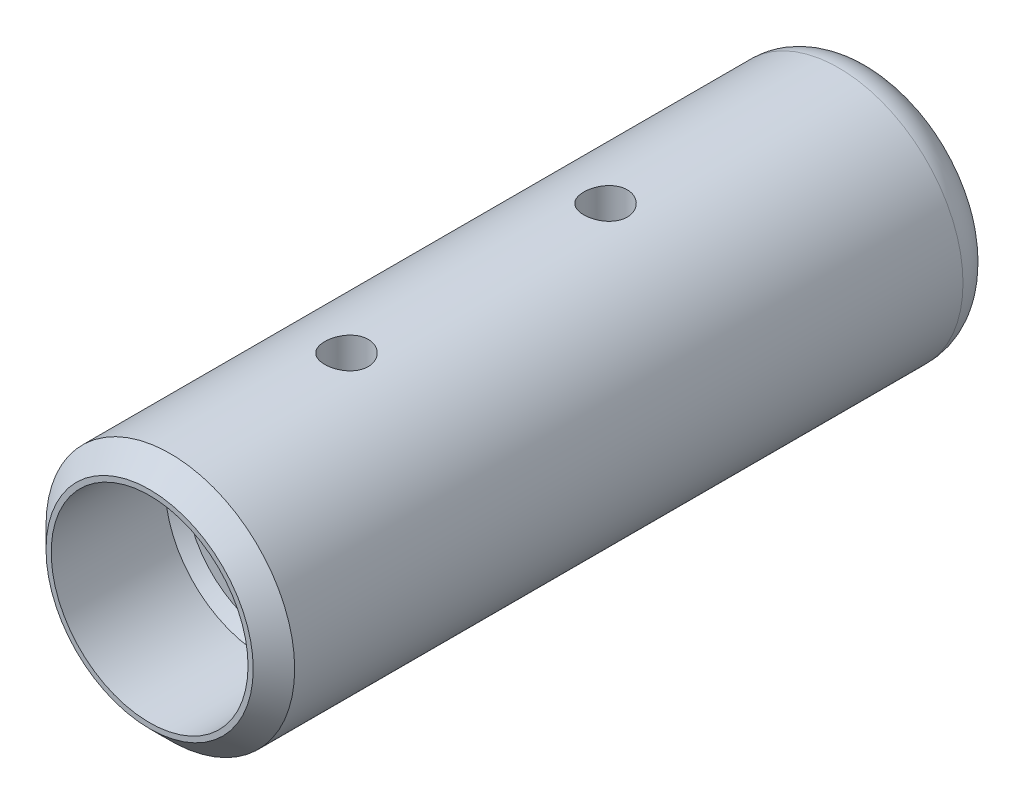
from build123d import *

# Parameters (mm, degrees)
ESQUISSE1_R                         = 12
BASE_EXTRUSION_DEPTH                = 70
CHANFREIN2_SIZE                     = 2
ESQUISSE2_R                         = 9.5
ENL_V_MAT_EXTRU_1_DEPTH             = 12
CHANFREIN3_SIZE                     = 1
DIAM_TRE_DU_PER_AGE_8_5_8_5_1_D     = 8.5
DIAM_TRE_DU_PER_AGE_8_5_8_5_1_DEPTH = 40
DIAM_TRE_DU_PER_AGE_8_5_8_5_1_TIP   = 2.553657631
ENL_V_MAT_EXTRU_2_REACH             = 76.967
ENL_V_MAT_EXTRU_2_END_RADIUS        = 4.25
ESQUISSE6_R                         = 2.1
CONG_1_R                            = 3.5
BOSS_EXTRU_1_REACH                  = 76.967
BOSS_EXTRU_1_END_RADIUS             = 12
ESQUISSE10_W                        = 11.941376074
ESQUISSE10_H                        = 36.669535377
ESQUISSE10_R                        = 2.1
ESQUISSE16_R                        = 19.918458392
ESQUISSE16_R_2                      = 12
ENL_V_MAT_EXTRU_3_DEPTH             = 73.027772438


with BuildPart() as part:
    # Esquisse1 → Base-Extrusion (new body)
    with BuildSketch(Plane.XY):
        Circle(ESQUISSE1_R)
    extrude(amount=BASE_EXTRUSION_DEPTH)

    # Chanfrein2
    chanfrein2_edges = [part.edges().sort_by_distance(p)[0] for p in [
        (-12, 0, 70),
    ]]
    chamfer(chanfrein2_edges, length=CHANFREIN2_SIZE)

    # Esquisse2 → Enl_v. mat.-Extru.1 (cut)
    with BuildSketch(Plane.XY.offset(70)):
        Circle(ESQUISSE2_R)
    extrude(amount=-ENL_V_MAT_EXTRU_1_DEPTH, mode=Mode.SUBTRACT)

    # Chanfrein3
    chanfrein3_edges = [part.edges().sort_by_distance(p)[0] for p in [
        (-9.5, 0, 58),
    ]]
    chamfer(chanfrein3_edges, length=CHANFREIN3_SIZE)

    # Diam_tre du per_age _8.5 _8.5_1
    with Locations(Plane.XY.offset(58)):
        with Locations((0, 0)):
            Hole(DIAM_TRE_DU_PER_AGE_8_5_8_5_1_D / 2, depth=DIAM_TRE_DU_PER_AGE_8_5_8_5_1_DEPTH)
            with Locations((0, 0, -(DIAM_TRE_DU_PER_AGE_8_5_8_5_1_DEPTH + DIAM_TRE_DU_PER_AGE_8_5_8_5_1_TIP / 2))):  # 118° drill point
                Cone(0, DIAM_TRE_DU_PER_AGE_8_5_8_5_1_D / 2, DIAM_TRE_DU_PER_AGE_8_5_8_5_1_TIP, mode=Mode.SUBTRACT)

    # Enl_v. mat.-Extru.2: up to this cylinder (the profile starts outside it)
    enl_v_mat_extru_2_end = Plane(origin=(0, 0, 38.5), z_dir=(0, 0, 1)) * Cylinder(ENL_V_MAT_EXTRU_2_END_RADIUS, 188.434, mode=Mode.PRIVATE)
    # Esquisse6 → Enl_v. mat.-Extru.2 (cut, up to the surface)
    with BuildSketch(Plane(origin=(0, 12, 0), x_dir=(-1, 0, 0), z_dir=(0, 1, 0)), mode=Mode.PRIVATE) as enl_v_mat_extru_2_sk1:
        with Locations(Location((0, 26, 0), (0, 0, 90))):
            Circle(ESQUISSE6_R)
    enl_v_mat_extru_2_tool1 = extrude(enl_v_mat_extru_2_sk1.sketch, amount=-ENL_V_MAT_EXTRU_2_REACH, mode=Mode.PRIVATE) - enl_v_mat_extru_2_end
    add(enl_v_mat_extru_2_tool1.solids().sort_by_distance((0, 12, 26))[0], mode=Mode.SUBTRACT)
    # Esquisse6 → Enl_v. mat.-Extru.2 (cut, up to the surface)
    with BuildSketch(Plane(origin=(0, 12, 0), x_dir=(-1, 0, 0), z_dir=(0, 1, 0)), mode=Mode.PRIVATE) as enl_v_mat_extru_2_sk2:
        with Locations(Location((0, 51, 0), (0, 0, 90))):
            Circle(ESQUISSE6_R)
    enl_v_mat_extru_2_tool2 = extrude(enl_v_mat_extru_2_sk2.sketch, amount=-ENL_V_MAT_EXTRU_2_REACH, mode=Mode.PRIVATE) - enl_v_mat_extru_2_end
    add(enl_v_mat_extru_2_tool2.solids().sort_by_distance((0, 12, 51))[0], mode=Mode.SUBTRACT)

    # Cong_1
    cong_1_edges = [part.edges().sort_by_distance(p)[0] for p in [
        (-12, 0, 0),
    ]]
    fillet(cong_1_edges, radius=CONG_1_R)

    # Boss.-Extru.1: up to this cylinder (the profile starts outside it)
    boss_extru_1_end = Plane(origin=(0, 0, 38.373632), z_dir=(0, 0, -1)) * Cylinder(BOSS_EXTRU_1_END_RADIUS, 178.934, mode=Mode.PRIVATE)
    # Esquisse10 → Boss.-Extru.1 (add, up to the surface)
    with BuildSketch(Plane(origin=(0, 12, 0), x_dir=(-1, 0, 0), z_dir=(0, 1, 0)), mode=Mode.PRIVATE) as boss_extru_1_sk1:
        with Locations((-0.052837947, 38.381628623)):
            Rectangle(ESQUISSE10_W, ESQUISSE10_H)
        with Locations(Location((0, 51, 0), (0, 0, 90))):
            Circle(ESQUISSE10_R, mode=Mode.SUBTRACT)
        with Locations(Location((0, 26, 0), (0, 0, 90))):
            Circle(ESQUISSE10_R, mode=Mode.SUBTRACT)
    boss_extru_1_tool1 = extrude(boss_extru_1_sk1.sketch, amount=-BOSS_EXTRU_1_REACH, mode=Mode.PRIVATE) - boss_extru_1_end
    add(boss_extru_1_tool1.solids().sort_by_distance((0.056407, 12, 38.373632))[0])
    add(boss_extru_1_tool1.solids().sort_by_distance((0.056407, 12, 38.373632))[1])

    # Esquisse16 → Enl_v. mat.-Extru.3 (cut, through all)
    with BuildSketch(Plane(origin=(0, 0, 0), x_dir=(-1, 0, 0), z_dir=(0, 0, -1))):
        Circle(ESQUISSE16_R)
        with Locations(Location((0, 0, 0), (0, 0, 180))):
            Circle(ESQUISSE16_R_2, mode=Mode.SUBTRACT)
    extrude(amount=-ENL_V_MAT_EXTRU_3_DEPTH, mode=Mode.SUBTRACT)


solid = part.part
